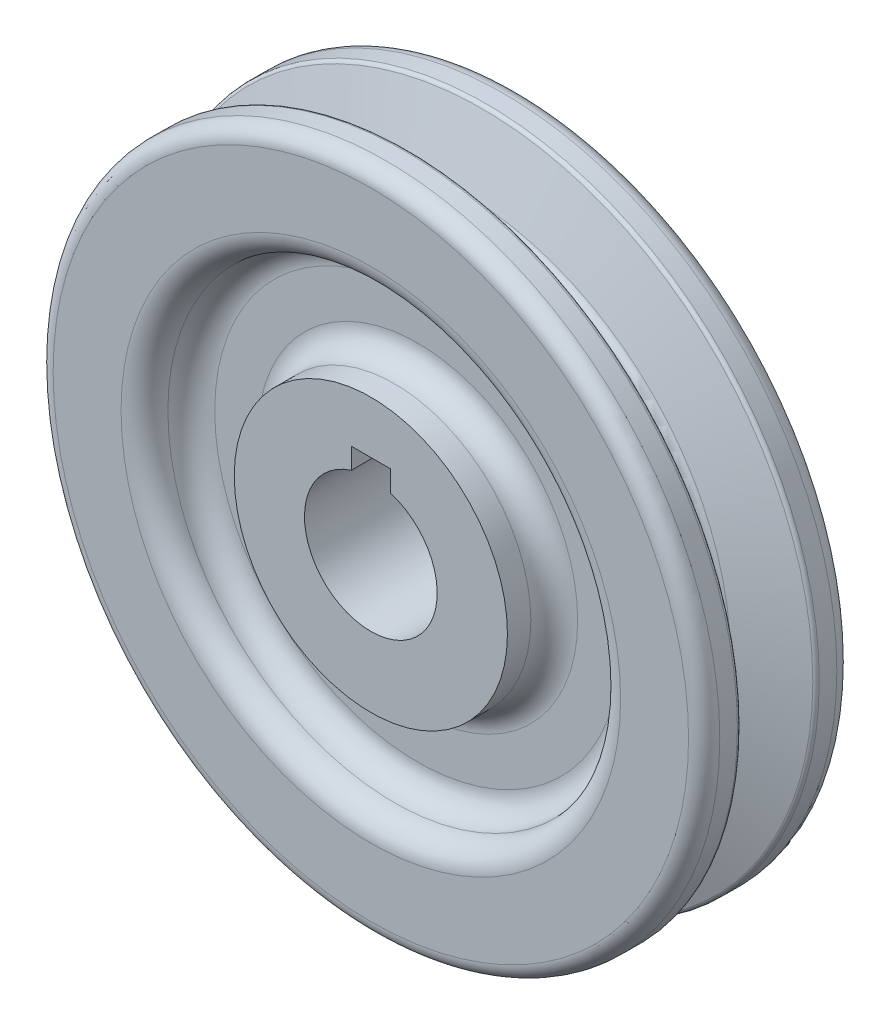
ISO-10303-21;
HEADER;
FILE_DESCRIPTION(('STEP AP214'),'2;1');
FILE_NAME('part.step','',(''),(''),'','','');
FILE_SCHEMA(('AUTOMOTIVE_DESIGN { 1 0 10303 214 1 1 1 1 }'));
ENDSEC;
DATA;
#1=APPLICATION_CONTEXT('core data for automotive mechanical design processes');
#2=APPLICATION_PROTOCOL_DEFINITION('international standard','automotive_design',2000,#1);
#3=PRODUCT_CONTEXT('',#1,'mechanical');
#4=PRODUCT('Part','Part','',(#3));
#5=PRODUCT_RELATED_PRODUCT_CATEGORY('part','',(#4));
#6=PRODUCT_DEFINITION_FORMATION('','',#4);
#7=PRODUCT_DEFINITION_CONTEXT('part definition',#1,'design');
#8=PRODUCT_DEFINITION('design','',#6,#7);
#9=PRODUCT_DEFINITION_SHAPE('','',#8);
#10=(LENGTH_UNIT() NAMED_UNIT(*) SI_UNIT(.MILLI.,.METRE.));
#11=(NAMED_UNIT(*) PLANE_ANGLE_UNIT() SI_UNIT($,.RADIAN.));
#12=(NAMED_UNIT(*) SI_UNIT($,.STERADIAN.) SOLID_ANGLE_UNIT());
#13=UNCERTAINTY_MEASURE_WITH_UNIT(LENGTH_MEASURE(1.E-05),#10,'distance_accuracy_value','');
#14=(GEOMETRIC_REPRESENTATION_CONTEXT(3) GLOBAL_UNCERTAINTY_ASSIGNED_CONTEXT((#13)) GLOBAL_UNIT_ASSIGNED_CONTEXT((#10,
#11,#12)) REPRESENTATION_CONTEXT('',''));
#15=CARTESIAN_POINT('',(0.,0.,0.));
#16=DIRECTION('',(0.,0.,1.));
#17=DIRECTION('',(1.,0.,0.));
#18=AXIS2_PLACEMENT_3D('',#15,#16,#17);
#19=CARTESIAN_POINT('',(0.,8.5,0.));
#20=DIRECTION('',(0.,0.,-1.));
#21=DIRECTION('',(-1.,0.,0.));
#22=AXIS2_PLACEMENT_3D('',#19,#20,#21);
#23=PLANE('',#22);
#24=CARTESIAN_POINT('',(0.,0.,0.));
#25=DIRECTION('',(0.,0.,1.));
#26=DIRECTION('',(1.,0.,0.));
#27=AXIS2_PLACEMENT_3D('',#24,#25,#26);
#28=CIRCLE('',#27,8.5);
#29=CARTESIAN_POINT('',(-2.5,8.12403840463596,0.));
#30=VERTEX_POINT('',#29);
#31=CARTESIAN_POINT('',(2.5,8.12403840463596,0.));
#32=VERTEX_POINT('',#31);
#33=EDGE_CURVE('E132',#30,#32,#28,.T.);
#34=ORIENTED_EDGE('',*,*,#33,.F.);
#35=DIRECTION('',(0.,1.,0.));
#36=VECTOR('',#35,1.);
#37=CARTESIAN_POINT('',(-2.5,8.5,0.));
#38=LINE('',#37,#36);
#39=CARTESIAN_POINT('',(-2.5,10.8,0.));
#40=VERTEX_POINT('',#39);
#41=EDGE_CURVE('E68',#30,#40,#38,.T.);
#42=ORIENTED_EDGE('',*,*,#41,.T.);
#43=DIRECTION('',(1.,0.,0.));
#44=VECTOR('',#43,1.);
#45=CARTESIAN_POINT('',(0.,10.8,0.));
#46=LINE('',#45,#44);
#47=CARTESIAN_POINT('',(2.5,10.8,0.));
#48=VERTEX_POINT('',#47);
#49=EDGE_CURVE('E96',#40,#48,#46,.T.);
#50=ORIENTED_EDGE('',*,*,#49,.T.);
#51=DIRECTION('',(0.,-1.,0.));
#52=VECTOR('',#51,1.);
#53=CARTESIAN_POINT('',(2.5,8.5,0.));
#54=LINE('',#53,#52);
#55=EDGE_CURVE('E93',#48,#32,#54,.T.);
#56=ORIENTED_EDGE('',*,*,#55,.T.);
#57=EDGE_LOOP('',(#34,#42,#50,#56));
#58=FACE_BOUND('',#57,.T.);
#59=CARTESIAN_POINT('',(0.,0.,0.));
#60=DIRECTION('',(0.,0.,1.));
#61=DIRECTION('',(1.,0.,0.));
#62=AXIS2_PLACEMENT_3D('',#59,#60,#61);
#63=CIRCLE('',#62,17.5);
#64=CARTESIAN_POINT('',(17.5,0.,0.));
#65=VERTEX_POINT('',#64);
#66=EDGE_CURVE('E215',#65,#65,#63,.T.);
#67=ORIENTED_EDGE('',*,*,#66,.T.);
#68=EDGE_LOOP('',(#67));
#69=FACE_BOUND('',#68,.T.);
#70=ADVANCED_FACE('F43',(#58,#69),#23,.F.);
#71=CARTESIAN_POINT('',(0.,42.7,-19.));
#72=DIRECTION('',(0.,0.,1.));
#73=DIRECTION('',(1.,0.,0.));
#74=AXIS2_PLACEMENT_3D('',#71,#72,#73);
#75=PLANE('',#74);
#76=DIRECTION('',(1.,0.,0.));
#77=VECTOR('',#76,1.);
#78=CARTESIAN_POINT('',(2.5,10.8,-19.));
#79=LINE('',#78,#77);
#80=CARTESIAN_POINT('',(-2.5,10.8,-19.));
#81=VERTEX_POINT('',#80);
#82=CARTESIAN_POINT('',(2.5,10.8,-19.));
#83=VERTEX_POINT('',#82);
#84=EDGE_CURVE('E99',#81,#83,#79,.T.);
#85=ORIENTED_EDGE('',*,*,#84,.F.);
#86=DIRECTION('',(0.,-1.,0.));
#87=VECTOR('',#86,1.);
#88=CARTESIAN_POINT('',(-2.5,42.7,-19.));
#89=LINE('',#88,#87);
#90=CARTESIAN_POINT('',(-2.5,8.12403840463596,-19.));
#91=VERTEX_POINT('',#90);
#92=EDGE_CURVE('E183',#81,#91,#89,.T.);
#93=ORIENTED_EDGE('',*,*,#92,.T.);
#94=CARTESIAN_POINT('',(0.,0.,-19.));
#95=DIRECTION('',(0.,0.,1.));
#96=DIRECTION('',(1.,0.,0.));
#97=AXIS2_PLACEMENT_3D('',#94,#95,#96);
#98=CIRCLE('',#97,8.5);
#99=CARTESIAN_POINT('',(2.5,8.12403840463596,-19.));
#100=VERTEX_POINT('',#99);
#101=EDGE_CURVE('E110',#91,#100,#98,.T.);
#102=ORIENTED_EDGE('',*,*,#101,.T.);
#103=DIRECTION('',(0.,-1.,0.));
#104=VECTOR('',#103,1.);
#105=CARTESIAN_POINT('',(2.5,6.2,-19.));
#106=LINE('',#105,#104);
#107=EDGE_CURVE('E90',#83,#100,#106,.T.);
#108=ORIENTED_EDGE('',*,*,#107,.F.);
#109=EDGE_LOOP('',(#85,#93,#102,#108));
#110=FACE_BOUND('',#109,.T.);
#111=CARTESIAN_POINT('',(0.,0.,-19.));
#112=DIRECTION('',(0.,0.,-1.));
#113=DIRECTION('',(-1.,0.,0.));
#114=AXIS2_PLACEMENT_3D('',#111,#112,#113);
#115=CIRCLE('',#114,17.5);
#116=CARTESIAN_POINT('',(-17.5,0.,-19.));
#117=VERTEX_POINT('',#116);
#118=EDGE_CURVE('E104',#117,#117,#115,.T.);
#119=ORIENTED_EDGE('',*,*,#118,.T.);
#120=EDGE_LOOP('',(#119));
#121=FACE_BOUND('',#120,.T.);
#122=ADVANCED_FACE('F107',(#110,#121),#75,.F.);
#123=CARTESIAN_POINT('',(0.,0.,0.));
#124=DIRECTION('',(0.,0.,1.));
#125=DIRECTION('',(1.,0.,0.));
#126=AXIS2_PLACEMENT_3D('',#123,#124,#125);
#127=CYLINDRICAL_SURFACE('',#126,8.5);
#128=ORIENTED_EDGE('',*,*,#101,.F.);
#129=DIRECTION('',(0.,0.,1.));
#130=VECTOR('',#129,1.);
#131=CARTESIAN_POINT('',(-2.5,8.12403840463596,0.));
#132=LINE('',#131,#130);
#133=EDGE_CURVE('E128',#91,#30,#132,.T.);
#134=ORIENTED_EDGE('',*,*,#133,.T.);
#135=ORIENTED_EDGE('',*,*,#33,.T.);
#136=DIRECTION('',(0.,0.,1.));
#137=VECTOR('',#136,1.);
#138=CARTESIAN_POINT('',(2.5,8.12403840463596,0.));
#139=LINE('',#138,#137);
#140=EDGE_CURVE('E123',#32,#100,#139,.F.);
#141=ORIENTED_EDGE('',*,*,#140,.T.);
#142=EDGE_LOOP('',(#128,#134,#135,#141));
#143=FACE_BOUND('',#142,.T.);
#144=ADVANCED_FACE('F248',(#143),#127,.F.);
#145=CARTESIAN_POINT('',(0.,0.,0.));
#146=DIRECTION('',(0.,0.,-1.));
#147=DIRECTION('',(-1.,0.,0.));
#148=AXIS2_PLACEMENT_3D('',#145,#146,#147);
#149=CIRCLE('',#148,32.);
#150=CARTESIAN_POINT('',(-32.,0.,0.));
#151=VERTEX_POINT('',#150);
#152=EDGE_CURVE('E202',#151,#151,#149,.T.);
#153=ORIENTED_EDGE('',*,*,#152,.T.);
#154=EDGE_LOOP('',(#153));
#155=FACE_BOUND('',#154,.T.);
#156=CARTESIAN_POINT('',(0.,0.,0.));
#157=DIRECTION('',(0.,0.,-1.));
#158=DIRECTION('',(-1.,0.,0.));
#159=AXIS2_PLACEMENT_3D('',#156,#157,#158);
#160=CIRCLE('',#159,40.7);
#161=CARTESIAN_POINT('',(-40.7,0.,0.));
#162=VERTEX_POINT('',#161);
#163=EDGE_CURVE('E176',#162,#162,#160,.F.);
#164=ORIENTED_EDGE('',*,*,#163,.T.);
#165=EDGE_LOOP('',(#164));
#166=FACE_BOUND('',#165,.T.);
#167=ADVANCED_FACE('F244',(#155,#166),#23,.F.);
#168=CARTESIAN_POINT('',(0.,0.,0.));
#169=DIRECTION('',(0.,0.,1.));
#170=DIRECTION('',(1.,0.,0.));
#171=AXIS2_PLACEMENT_3D('',#168,#169,#170);
#172=CYLINDRICAL_SURFACE('',#171,42.7);
#173=CARTESIAN_POINT('',(0.,0.,-4.25944555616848));
#174=DIRECTION('',(0.,0.,-1.));
#175=DIRECTION('',(-1.,0.,0.));
#176=AXIS2_PLACEMENT_3D('',#173,#174,#175);
#177=CIRCLE('',#176,42.7);
#178=CARTESIAN_POINT('',(-42.7,0.,-4.25944555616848));
#179=VERTEX_POINT('',#178);
#180=EDGE_CURVE('E140',#179,#179,#177,.F.);
#181=ORIENTED_EDGE('',*,*,#180,.T.);
#182=EDGE_LOOP('',(#181));
#183=FACE_BOUND('',#182,.T.);
#184=CARTESIAN_POINT('',(0.,0.,-2.));
#185=DIRECTION('',(0.,0.,-1.));
#186=DIRECTION('',(-1.,0.,0.));
#187=AXIS2_PLACEMENT_3D('',#184,#185,#186);
#188=CIRCLE('',#187,42.7);
#189=CARTESIAN_POINT('',(-42.7,0.,-2.));
#190=VERTEX_POINT('',#189);
#191=EDGE_CURVE('E136',#190,#190,#188,.T.);
#192=ORIENTED_EDGE('',*,*,#191,.T.);
#193=EDGE_LOOP('',(#192));
#194=FACE_BOUND('',#193,.T.);
#195=ADVANCED_FACE('F256',(#183,#194),#172,.T.);
#196=CARTESIAN_POINT('',(0.,0.,-7.54699408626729));
#197=DIRECTION('',(0.,0.,1.));
#198=DIRECTION('',(1.,0.,0.));
#199=AXIS2_PLACEMENT_3D('',#196,#197,#198);
#200=CONICAL_SURFACE('',#199,33.7,1.25663706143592);
#201=CARTESIAN_POINT('',(0.,0.,-4.73497381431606));
#202=DIRECTION('',(0.,0.,-1.));
#203=DIRECTION('',(-1.,0.,0.));
#204=AXIS2_PLACEMENT_3D('',#201,#202,#203);
#205=CIRCLE('',#204,42.3545084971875);
#206=CARTESIAN_POINT('',(-42.3545084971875,0.,-4.73497381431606));
#207=VERTEX_POINT('',#206);
#208=EDGE_CURVE('E148',#207,#207,#205,.T.);
#209=ORIENTED_EDGE('',*,*,#208,.T.);
#210=EDGE_LOOP('',(#209));
#211=FACE_BOUND('',#210,.T.);
#212=CARTESIAN_POINT('',(0.,0.,-7.32248009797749));
#213=DIRECTION('',(0.,0.,1.));
#214=DIRECTION('',(1.,0.,0.));
#215=AXIS2_PLACEMENT_3D('',#212,#213,#214);
#216=CIRCLE('',#215,34.3909830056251);
#217=CARTESIAN_POINT('',(34.3909830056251,0.,-7.32248009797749));
#218=VERTEX_POINT('',#217);
#219=EDGE_CURVE('E144',#218,#218,#216,.T.);
#220=ORIENTED_EDGE('',*,*,#219,.T.);
#221=EDGE_LOOP('',(#220));
#222=FACE_BOUND('',#221,.T.);
#223=ADVANCED_FACE('F262',(#211,#222),#200,.T.);
#224=CARTESIAN_POINT('',(0.,0.,0.));
#225=DIRECTION('',(0.,0.,1.));
#226=DIRECTION('',(1.,0.,0.));
#227=AXIS2_PLACEMENT_3D('',#224,#225,#226);
#228=CYLINDRICAL_SURFACE('',#227,33.7);
#229=CARTESIAN_POINT('',(0.,0.,-10.7264633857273));
#230=DIRECTION('',(0.,0.,1.));
#231=DIRECTION('',(1.,0.,0.));
#232=AXIS2_PLACEMENT_3D('',#229,#230,#231);
#233=CIRCLE('',#232,33.7);
#234=CARTESIAN_POINT('',(33.7,0.,-10.7264633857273));
#235=VERTEX_POINT('',#234);
#236=EDGE_CURVE('E172',#235,#235,#233,.T.);
#237=ORIENTED_EDGE('',*,*,#236,.T.);
#238=EDGE_LOOP('',(#237));
#239=FACE_BOUND('',#238,.T.);
#240=CARTESIAN_POINT('',(0.,0.,-8.27353661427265));
#241=DIRECTION('',(0.,0.,1.));
#242=DIRECTION('',(1.,0.,0.));
#243=AXIS2_PLACEMENT_3D('',#240,#241,#242);
#244=CIRCLE('',#243,33.7);
#245=CARTESIAN_POINT('',(33.7,0.,-8.27353661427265));
#246=VERTEX_POINT('',#245);
#247=EDGE_CURVE('E168',#246,#246,#244,.F.);
#248=ORIENTED_EDGE('',*,*,#247,.T.);
#249=EDGE_LOOP('',(#248));
#250=FACE_BOUND('',#249,.T.);
#251=ADVANCED_FACE('F341',(#239,#250),#228,.T.);
#252=CARTESIAN_POINT('',(0.,0.,-14.3772831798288));
#253=DIRECTION('',(0.,0.,-1.));
#254=DIRECTION('',(-1.,0.,0.));
#255=AXIS2_PLACEMENT_3D('',#252,#253,#254);
#256=CONICAL_SURFACE('',#255,42.7,1.25663706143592);
#257=CARTESIAN_POINT('',(0.,0.,-14.2650261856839));
#258=DIRECTION('',(0.,0.,1.));
#259=DIRECTION('',(1.,0.,0.));
#260=AXIS2_PLACEMENT_3D('',#257,#258,#259);
#261=CIRCLE('',#260,42.3545084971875);
#262=CARTESIAN_POINT('',(42.3545084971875,0.,-14.2650261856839));
#263=VERTEX_POINT('',#262);
#264=EDGE_CURVE('E156',#263,#263,#261,.T.);
#265=ORIENTED_EDGE('',*,*,#264,.T.);
#266=EDGE_LOOP('',(#265));
#267=FACE_BOUND('',#266,.T.);
#268=CARTESIAN_POINT('',(0.,0.,-11.6775199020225));
#269=DIRECTION('',(0.,0.,-1.));
#270=DIRECTION('',(-1.,0.,0.));
#271=AXIS2_PLACEMENT_3D('',#268,#269,#270);
#272=CIRCLE('',#271,34.3909830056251);
#273=CARTESIAN_POINT('',(-34.3909830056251,0.,-11.6775199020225));
#274=VERTEX_POINT('',#273);
#275=EDGE_CURVE('E152',#274,#274,#272,.T.);
#276=ORIENTED_EDGE('',*,*,#275,.T.);
#277=EDGE_LOOP('',(#276));
#278=FACE_BOUND('',#277,.T.);
#279=ADVANCED_FACE('F337',(#267,#278),#256,.T.);
#280=CARTESIAN_POINT('',(0.,0.,0.));
#281=DIRECTION('',(0.,0.,1.));
#282=DIRECTION('',(1.,0.,0.));
#283=AXIS2_PLACEMENT_3D('',#280,#281,#282);
#284=CYLINDRICAL_SURFACE('',#283,42.7);
#285=CARTESIAN_POINT('',(0.,0.,-14.7405544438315));
#286=DIRECTION('',(0.,0.,-1.));
#287=DIRECTION('',(-1.,0.,0.));
#288=AXIS2_PLACEMENT_3D('',#285,#286,#287);
#289=CIRCLE('',#288,42.7);
#290=CARTESIAN_POINT('',(-42.7,0.,-14.7405544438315));
#291=VERTEX_POINT('',#290);
#292=EDGE_CURVE('E164',#291,#291,#289,.T.);
#293=ORIENTED_EDGE('',*,*,#292,.T.);
#294=EDGE_LOOP('',(#293));
#295=FACE_BOUND('',#294,.T.);
#296=CARTESIAN_POINT('',(0.,0.,-17.));
#297=DIRECTION('',(0.,0.,1.));
#298=DIRECTION('',(1.,0.,0.));
#299=AXIS2_PLACEMENT_3D('',#296,#297,#298);
#300=CIRCLE('',#299,42.7);
#301=CARTESIAN_POINT('',(42.7,0.,-17.));
#302=VERTEX_POINT('',#301);
#303=EDGE_CURVE('E160',#302,#302,#300,.T.);
#304=ORIENTED_EDGE('',*,*,#303,.T.);
#305=EDGE_LOOP('',(#304));
#306=FACE_BOUND('',#305,.T.);
#307=ADVANCED_FACE('F333',(#295,#306),#284,.T.);
#308=CARTESIAN_POINT('',(0.,0.,-19.));
#309=DIRECTION('',(0.,0.,1.));
#310=DIRECTION('',(1.,0.,0.));
#311=AXIS2_PLACEMENT_3D('',#308,#309,#310);
#312=CIRCLE('',#311,32.);
#313=CARTESIAN_POINT('',(32.,0.,-19.));
#314=VERTEX_POINT('',#313);
#315=EDGE_CURVE('E186',#314,#314,#312,.T.);
#316=ORIENTED_EDGE('',*,*,#315,.T.);
#317=EDGE_LOOP('',(#316));
#318=FACE_BOUND('',#317,.T.);
#319=CARTESIAN_POINT('',(0.,0.,-19.));
#320=DIRECTION('',(0.,0.,1.));
#321=DIRECTION('',(1.,0.,0.));
#322=AXIS2_PLACEMENT_3D('',#319,#320,#321);
#323=CIRCLE('',#322,40.7);
#324=CARTESIAN_POINT('',(40.7,0.,-19.));
#325=VERTEX_POINT('',#324);
#326=EDGE_CURVE('E180',#325,#325,#323,.F.);
#327=ORIENTED_EDGE('',*,*,#326,.T.);
#328=EDGE_LOOP('',(#327));
#329=FACE_BOUND('',#328,.T.);
#330=ADVANCED_FACE('F250',(#318,#329),#75,.F.);
#331=CARTESIAN_POINT('',(0.,0.,-4.25944555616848));
#332=DIRECTION('',(0.,0.,-1.));
#333=DIRECTION('',(-1.,0.,0.));
#334=AXIS2_PLACEMENT_3D('',#331,#332,#333);
#335=TOROIDAL_SURFACE('',#334,42.2,0.5);
#336=ORIENTED_EDGE('',*,*,#208,.F.);
#337=EDGE_LOOP('',(#336));
#338=FACE_BOUND('',#337,.T.);
#339=ORIENTED_EDGE('',*,*,#180,.F.);
#340=EDGE_LOOP('',(#339));
#341=FACE_BOUND('',#340,.T.);
#342=ADVANCED_FACE('F332',(#338,#341),#335,.T.);
#343=CARTESIAN_POINT('',(0.,0.,-14.7405544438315));
#344=DIRECTION('',(0.,0.,-1.));
#345=DIRECTION('',(-1.,0.,0.));
#346=AXIS2_PLACEMENT_3D('',#343,#344,#345);
#347=TOROIDAL_SURFACE('',#346,42.2,0.5);
#348=ORIENTED_EDGE('',*,*,#292,.F.);
#349=EDGE_LOOP('',(#348));
#350=FACE_BOUND('',#349,.T.);
#351=ORIENTED_EDGE('',*,*,#264,.F.);
#352=EDGE_LOOP('',(#351));
#353=FACE_BOUND('',#352,.T.);
#354=ADVANCED_FACE('F357',(#350,#353),#347,.T.);
#355=CARTESIAN_POINT('',(0.,0.,-10.7264633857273));
#356=DIRECTION('',(0.,0.,1.));
#357=DIRECTION('',(1.,0.,0.));
#358=AXIS2_PLACEMENT_3D('',#355,#356,#357);
#359=TOROIDAL_SURFACE('',#358,34.7,1.);
#360=ORIENTED_EDGE('',*,*,#275,.F.);
#361=EDGE_LOOP('',(#360));
#362=FACE_BOUND('',#361,.T.);
#363=ORIENTED_EDGE('',*,*,#236,.F.);
#364=EDGE_LOOP('',(#363));
#365=FACE_BOUND('',#364,.T.);
#366=ADVANCED_FACE('F282',(#362,#365),#359,.F.);
#367=CARTESIAN_POINT('',(0.,0.,-8.27353661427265));
#368=DIRECTION('',(0.,0.,1.));
#369=DIRECTION('',(1.,0.,0.));
#370=AXIS2_PLACEMENT_3D('',#367,#368,#369);
#371=TOROIDAL_SURFACE('',#370,34.7,1.);
#372=ORIENTED_EDGE('',*,*,#247,.F.);
#373=EDGE_LOOP('',(#372));
#374=FACE_BOUND('',#373,.T.);
#375=ORIENTED_EDGE('',*,*,#219,.F.);
#376=EDGE_LOOP('',(#375));
#377=FACE_BOUND('',#376,.T.);
#378=ADVANCED_FACE('F272',(#374,#377),#371,.F.);
#379=CARTESIAN_POINT('',(0.,0.,-2.));
#380=DIRECTION('',(0.,0.,-1.));
#381=DIRECTION('',(-1.,0.,0.));
#382=AXIS2_PLACEMENT_3D('',#379,#380,#381);
#383=TOROIDAL_SURFACE('',#382,40.7,2.);
#384=ORIENTED_EDGE('',*,*,#191,.F.);
#385=EDGE_LOOP('',(#384));
#386=FACE_BOUND('',#385,.T.);
#387=ORIENTED_EDGE('',*,*,#163,.F.);
#388=EDGE_LOOP('',(#387));
#389=FACE_BOUND('',#388,.T.);
#390=ADVANCED_FACE('F269',(#386,#389),#383,.T.);
#391=CARTESIAN_POINT('',(0.,0.,-17.));
#392=DIRECTION('',(0.,0.,1.));
#393=DIRECTION('',(1.,0.,0.));
#394=AXIS2_PLACEMENT_3D('',#391,#392,#393);
#395=TOROIDAL_SURFACE('',#394,40.7,2.);
#396=ORIENTED_EDGE('',*,*,#326,.F.);
#397=EDGE_LOOP('',(#396));
#398=FACE_BOUND('',#397,.T.);
#399=ORIENTED_EDGE('',*,*,#303,.F.);
#400=EDGE_LOOP('',(#399));
#401=FACE_BOUND('',#400,.T.);
#402=ADVANCED_FACE('F271',(#398,#401),#395,.T.);
#403=CARTESIAN_POINT('',(-2.5,6.2,6.00000000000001));
#404=DIRECTION('',(-1.,0.,0.));
#405=DIRECTION('',(0.,0.,1.));
#406=AXIS2_PLACEMENT_3D('',#403,#404,#405);
#407=PLANE('',#406);
#408=ORIENTED_EDGE('',*,*,#92,.F.);
#409=DIRECTION('',(0.,0.,-1.));
#410=VECTOR('',#409,1.);
#411=CARTESIAN_POINT('',(-2.5,10.8,6.00000000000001));
#412=LINE('',#411,#410);
#413=EDGE_CURVE('E61',#40,#81,#412,.T.);
#414=ORIENTED_EDGE('',*,*,#413,.F.);
#415=ORIENTED_EDGE('',*,*,#41,.F.);
#416=ORIENTED_EDGE('',*,*,#133,.F.);
#417=EDGE_LOOP('',(#408,#414,#415,#416));
#418=FACE_BOUND('',#417,.T.);
#419=ADVANCED_FACE('F279',(#418),#407,.F.);
#420=CARTESIAN_POINT('',(2.5,6.2,6.00000000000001));
#421=DIRECTION('',(1.,0.,0.));
#422=DIRECTION('',(0.,0.,-1.));
#423=AXIS2_PLACEMENT_3D('',#420,#421,#422);
#424=PLANE('',#423);
#425=ORIENTED_EDGE('',*,*,#55,.F.);
#426=DIRECTION('',(0.,0.,-1.));
#427=VECTOR('',#426,1.);
#428=CARTESIAN_POINT('',(2.5,10.8,6.00000000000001));
#429=LINE('',#428,#427);
#430=EDGE_CURVE('E87',#48,#83,#429,.T.);
#431=ORIENTED_EDGE('',*,*,#430,.T.);
#432=ORIENTED_EDGE('',*,*,#107,.T.);
#433=ORIENTED_EDGE('',*,*,#140,.F.);
#434=EDGE_LOOP('',(#425,#431,#432,#433));
#435=FACE_BOUND('',#434,.T.);
#436=ADVANCED_FACE('F88',(#435),#424,.F.);
#437=CARTESIAN_POINT('',(2.5,10.8,6.00000000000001));
#438=DIRECTION('',(0.,1.,0.));
#439=DIRECTION('',(0.,0.,1.));
#440=AXIS2_PLACEMENT_3D('',#437,#438,#439);
#441=PLANE('',#440);
#442=ORIENTED_EDGE('',*,*,#413,.T.);
#443=ORIENTED_EDGE('',*,*,#84,.T.);
#444=ORIENTED_EDGE('',*,*,#430,.F.);
#445=ORIENTED_EDGE('',*,*,#49,.F.);
#446=EDGE_LOOP('',(#442,#443,#444,#445));
#447=FACE_BOUND('',#446,.T.);
#448=ADVANCED_FACE('F100',(#447),#441,.F.);
#449=CARTESIAN_POINT('',(0.,0.,-13.));
#450=DIRECTION('',(0.,0.,-1.));
#451=DIRECTION('',(-1.,0.,0.));
#452=AXIS2_PLACEMENT_3D('',#449,#450,#451);
#453=PLANE('',#452);
#454=CARTESIAN_POINT('',(0.,0.,-13.));
#455=DIRECTION('',(0.,0.,-1.));
#456=DIRECTION('',(-1.,0.,0.));
#457=AXIS2_PLACEMENT_3D('',#454,#455,#456);
#458=CIRCLE('',#457,26.);
#459=CARTESIAN_POINT('',(-26.,0.,-13.));
#460=VERTEX_POINT('',#459);
#461=EDGE_CURVE('E194',#460,#460,#458,.T.);
#462=ORIENTED_EDGE('',*,*,#461,.T.);
#463=EDGE_LOOP('',(#462));
#464=FACE_BOUND('',#463,.T.);
#465=CARTESIAN_POINT('',(0.,0.,-13.));
#466=DIRECTION('',(0.,0.,-1.));
#467=DIRECTION('',(-1.,0.,0.));
#468=AXIS2_PLACEMENT_3D('',#465,#466,#467);
#469=CIRCLE('',#468,20.5);
#470=CARTESIAN_POINT('',(-20.5,0.,-13.));
#471=VERTEX_POINT('',#470);
#472=EDGE_CURVE('E190',#471,#471,#469,.F.);
#473=ORIENTED_EDGE('',*,*,#472,.T.);
#474=EDGE_LOOP('',(#473));
#475=FACE_BOUND('',#474,.T.);
#476=ADVANCED_FACE('F304',(#464,#475),#453,.T.);
#477=CARTESIAN_POINT('',(0.,0.,-13.));
#478=DIRECTION('',(0.,0.,-1.));
#479=DIRECTION('',(-1.,0.,0.));
#480=AXIS2_PLACEMENT_3D('',#477,#478,#479);
#481=CYLINDRICAL_SURFACE('',#480,17.5);
#482=CARTESIAN_POINT('',(0.,0.,-16.));
#483=DIRECTION('',(0.,0.,-1.));
#484=DIRECTION('',(-1.,0.,0.));
#485=AXIS2_PLACEMENT_3D('',#482,#483,#484);
#486=CIRCLE('',#485,17.5);
#487=CARTESIAN_POINT('',(-17.5,0.,-16.));
#488=VERTEX_POINT('',#487);
#489=EDGE_CURVE('E198',#488,#488,#486,.T.);
#490=ORIENTED_EDGE('',*,*,#489,.T.);
#491=EDGE_LOOP('',(#490));
#492=FACE_BOUND('',#491,.T.);
#493=ORIENTED_EDGE('',*,*,#118,.F.);
#494=EDGE_LOOP('',(#493));
#495=FACE_BOUND('',#494,.T.);
#496=ADVANCED_FACE('F307',(#492,#495),#481,.T.);
#497=CARTESIAN_POINT('',(0.,0.,-6.));
#498=DIRECTION('',(0.,0.,1.));
#499=DIRECTION('',(1.,0.,0.));
#500=AXIS2_PLACEMENT_3D('',#497,#498,#499);
#501=PLANE('',#500);
#502=CARTESIAN_POINT('',(0.,0.,-6.));
#503=DIRECTION('',(0.,0.,1.));
#504=DIRECTION('',(1.,0.,0.));
#505=AXIS2_PLACEMENT_3D('',#502,#503,#504);
#506=CIRCLE('',#505,26.);
#507=CARTESIAN_POINT('',(26.,0.,-6.));
#508=VERTEX_POINT('',#507);
#509=EDGE_CURVE('E53',#508,#508,#506,.T.);
#510=ORIENTED_EDGE('',*,*,#509,.T.);
#511=EDGE_LOOP('',(#510));
#512=FACE_BOUND('',#511,.T.);
#513=CARTESIAN_POINT('',(0.,0.,-6.));
#514=DIRECTION('',(0.,0.,1.));
#515=DIRECTION('',(1.,0.,0.));
#516=AXIS2_PLACEMENT_3D('',#513,#514,#515);
#517=CIRCLE('',#516,20.5);
#518=CARTESIAN_POINT('',(20.5,0.,-6.));
#519=VERTEX_POINT('',#518);
#520=EDGE_CURVE('E206',#519,#519,#517,.F.);
#521=ORIENTED_EDGE('',*,*,#520,.T.);
#522=EDGE_LOOP('',(#521));
#523=FACE_BOUND('',#522,.T.);
#524=ADVANCED_FACE('F298',(#512,#523),#501,.T.);
#525=CARTESIAN_POINT('',(0.,0.,-6.));
#526=DIRECTION('',(0.,0.,1.));
#527=DIRECTION('',(1.,0.,0.));
#528=AXIS2_PLACEMENT_3D('',#525,#526,#527);
#529=CYLINDRICAL_SURFACE('',#528,17.5);
#530=CARTESIAN_POINT('',(0.,0.,-3.));
#531=DIRECTION('',(0.,0.,1.));
#532=DIRECTION('',(1.,0.,0.));
#533=AXIS2_PLACEMENT_3D('',#530,#531,#532);
#534=CIRCLE('',#533,17.5);
#535=CARTESIAN_POINT('',(17.5,0.,-3.));
#536=VERTEX_POINT('',#535);
#537=EDGE_CURVE('E12',#536,#536,#534,.T.);
#538=ORIENTED_EDGE('',*,*,#537,.T.);
#539=EDGE_LOOP('',(#538));
#540=FACE_BOUND('',#539,.T.);
#541=ORIENTED_EDGE('',*,*,#66,.F.);
#542=EDGE_LOOP('',(#541));
#543=FACE_BOUND('',#542,.T.);
#544=ADVANCED_FACE('F293',(#540,#543),#529,.T.);
#545=CARTESIAN_POINT('',(0.,0.,-16.));
#546=DIRECTION('',(0.,0.,-1.));
#547=DIRECTION('',(-1.,0.,0.));
#548=AXIS2_PLACEMENT_3D('',#545,#546,#547);
#549=TOROIDAL_SURFACE('',#548,26.,3.);
#550=ORIENTED_EDGE('',*,*,#461,.F.);
#551=EDGE_LOOP('',(#550));
#552=FACE_BOUND('',#551,.T.);
#553=CARTESIAN_POINT('',(0.,0.,-16.));
#554=DIRECTION('',(0.,0.,-1.));
#555=DIRECTION('',(-1.,0.,0.));
#556=AXIS2_PLACEMENT_3D('',#553,#554,#555);
#557=CIRCLE('',#556,29.);
#558=CARTESIAN_POINT('',(-29.,0.,-16.));
#559=VERTEX_POINT('',#558);
#560=EDGE_CURVE('E212',#559,#559,#557,.F.);
#561=ORIENTED_EDGE('',*,*,#560,.F.);
#562=EDGE_LOOP('',(#561));
#563=FACE_BOUND('',#562,.T.);
#564=ADVANCED_FACE('F290',(#552,#563),#549,.F.);
#565=CARTESIAN_POINT('',(0.,0.,-16.));
#566=DIRECTION('',(0.,0.,1.));
#567=DIRECTION('',(1.,0.,0.));
#568=AXIS2_PLACEMENT_3D('',#565,#566,#567);
#569=TOROIDAL_SURFACE('',#568,32.,3.);
#570=ORIENTED_EDGE('',*,*,#315,.F.);
#571=EDGE_LOOP('',(#570));
#572=FACE_BOUND('',#571,.T.);
#573=ORIENTED_EDGE('',*,*,#560,.T.);
#574=EDGE_LOOP('',(#573));
#575=FACE_BOUND('',#574,.T.);
#576=ADVANCED_FACE('F237',(#572,#575),#569,.T.);
#577=CARTESIAN_POINT('',(0.,0.,-16.));
#578=DIRECTION('',(0.,0.,-1.));
#579=DIRECTION('',(-1.,0.,0.));
#580=AXIS2_PLACEMENT_3D('',#577,#578,#579);
#581=TOROIDAL_SURFACE('',#580,20.5,3.);
#582=ORIENTED_EDGE('',*,*,#472,.F.);
#583=EDGE_LOOP('',(#582));
#584=FACE_BOUND('',#583,.T.);
#585=ORIENTED_EDGE('',*,*,#489,.F.);
#586=EDGE_LOOP('',(#585));
#587=FACE_BOUND('',#586,.T.);
#588=ADVANCED_FACE('F229',(#584,#587),#581,.F.);
#589=CARTESIAN_POINT('',(0.,0.,-3.));
#590=DIRECTION('',(0.,0.,1.));
#591=DIRECTION('',(1.,0.,0.));
#592=AXIS2_PLACEMENT_3D('',#589,#590,#591);
#593=TOROIDAL_SURFACE('',#592,26.,3.);
#594=ORIENTED_EDGE('',*,*,#509,.F.);
#595=EDGE_LOOP('',(#594));
#596=FACE_BOUND('',#595,.T.);
#597=CARTESIAN_POINT('',(0.,0.,-3.));
#598=DIRECTION('',(0.,0.,1.));
#599=DIRECTION('',(1.,0.,0.));
#600=AXIS2_PLACEMENT_3D('',#597,#598,#599);
#601=CIRCLE('',#600,29.);
#602=CARTESIAN_POINT('',(29.,0.,-3.));
#603=VERTEX_POINT('',#602);
#604=EDGE_CURVE('E47',#603,#603,#601,.F.);
#605=ORIENTED_EDGE('',*,*,#604,.F.);
#606=EDGE_LOOP('',(#605));
#607=FACE_BOUND('',#606,.T.);
#608=ADVANCED_FACE('F227',(#596,#607),#593,.F.);
#609=CARTESIAN_POINT('',(0.,0.,-3.));
#610=DIRECTION('',(0.,0.,-1.));
#611=DIRECTION('',(-1.,0.,0.));
#612=AXIS2_PLACEMENT_3D('',#609,#610,#611);
#613=TOROIDAL_SURFACE('',#612,32.,3.);
#614=ORIENTED_EDGE('',*,*,#152,.F.);
#615=EDGE_LOOP('',(#614));
#616=FACE_BOUND('',#615,.T.);
#617=ORIENTED_EDGE('',*,*,#604,.T.);
#618=EDGE_LOOP('',(#617));
#619=FACE_BOUND('',#618,.T.);
#620=ADVANCED_FACE('F225',(#616,#619),#613,.T.);
#621=CARTESIAN_POINT('',(0.,0.,-3.));
#622=DIRECTION('',(0.,0.,1.));
#623=DIRECTION('',(1.,0.,0.));
#624=AXIS2_PLACEMENT_3D('',#621,#622,#623);
#625=TOROIDAL_SURFACE('',#624,20.5,3.);
#626=ORIENTED_EDGE('',*,*,#520,.F.);
#627=EDGE_LOOP('',(#626));
#628=FACE_BOUND('',#627,.T.);
#629=ORIENTED_EDGE('',*,*,#537,.F.);
#630=EDGE_LOOP('',(#629));
#631=FACE_BOUND('',#630,.T.);
#632=ADVANCED_FACE('F45',(#628,#631),#625,.F.);
#633=CLOSED_SHELL('',(#70,#122,#144,#167,#195,#223,#251,#279,#307,#330,#342,#354,#366,#378,#390,
#402,#419,#436,#448,#476,#496,#524,#544,#564,#576,#588,#608,#620,#632));
#634=MANIFOLD_SOLID_BREP('B2',#633);
#635=ADVANCED_BREP_SHAPE_REPRESENTATION('',(#18,#634),#14);
#636=SHAPE_DEFINITION_REPRESENTATION(#9,#635);
ENDSEC;
END-ISO-10303-21;
